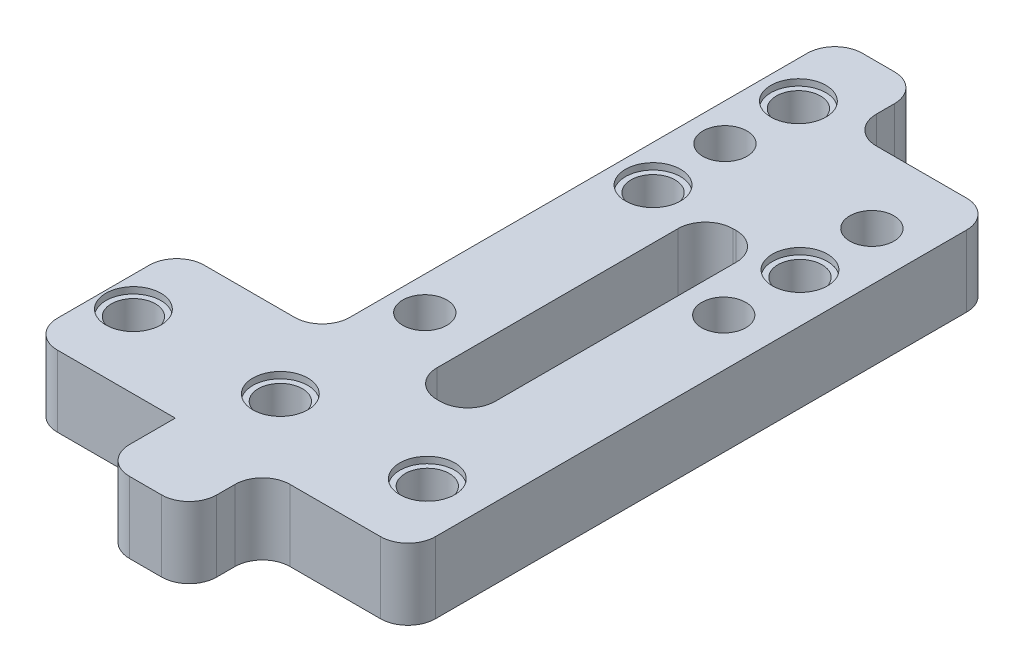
from build123d import *

# Parameters (mm, degrees)
BOSS_EXTRUDE1_DEPTH = 7.75
SKETCH2_W           = 6.34
SKETCH2_H           = 32.23
CUT_EXTRUDE1_DEPTH  = 84.146941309
SKETCH3_R           = 2.4
CUT_EXTRUDE2_DEPTH  = 84.146941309
SKETCH4_R           = 3
CUT_EXTRUDE3_DEPTH  = 0.7
CUT_EXTRUDE4_START  = -0.7
SKETCH5_R           = 3
CUT_EXTRUDE4_DEPTH  = 0.7
FILLET2_R           = 3
SKETCH6_R           = 2.4
CUT_EXTRUDE5_DEPTH  = 84.146941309
SKETCH7_R           = 2.4
CUT_EXTRUDE6_DEPTH  = 84.146941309
SKETCH8_R           = 2.4
CUT_EXTRUDE7_DEPTH  = 84.146941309
SKETCH9_R           = 3
CUT_EXTRUDE8_DEPTH  = 0.7
CUT_EXTRUDE9_START  = -0.7
SKETCH10_R          = 3
CUT_EXTRUDE9_DEPTH  = 0.7


with BuildPart() as part:
    # Sketch1 → Boss-Extrude1 (new body)
    with BuildSketch(Plane(origin=(0, 0, 0), x_dir=(1, 0, 0), z_dir=(0, 1, 0))):
        Polygon((0, 0), (15.841, 0), (15.841, -7.985), (25.341, -7.985), (25.341, 0), (41.182, 0), (41.182, 63.83), (25.341, 63.83), (25.341, 71.815), (15.841, 71.815), (15.841, 16), (0, 16), align=None)
    extrude(amount=BOSS_EXTRUDE1_DEPTH)

    # Sketch2 → Cut-Extrude1 (cut, through all)
    with BuildSketch(Plane(origin=(0, 7.75, 0), x_dir=(1, 0, 0), z_dir=(0, 1, 0))):
        with Locations((28.511, 32.115)):
            Rectangle(SKETCH2_W, SKETCH2_H)
    extrude(amount=-CUT_EXTRUDE1_DEPTH, mode=Mode.SUBTRACT)

    # Sketch3 → Cut-Extrude2 (cut, through all)
    with BuildSketch(Plane(origin=(0, 7.75, 0), x_dir=(-1, 0, 0), z_dir=(0, 1, 0))):
        with Locations(Location((-3.282, -8, 0), (0, 0, 90))):
            Circle(SKETCH3_R)
        with Locations(Location((-35.282, -8, 0), (0, 0, 90))):
            Circle(SKETCH3_R)
        with Locations(Location((-19.282, -8, 0), (0, 0, 90))):
            Circle(SKETCH3_R)
        with Locations(Location((-19.882, -55.81, 0), (0, 0, 90))):
            Circle(SKETCH3_R)
        with Locations(Location((-35.882, -55.81, 0), (0, 0, 90))):
            Circle(SKETCH3_R)
    extrude(amount=-CUT_EXTRUDE2_DEPTH, mode=Mode.SUBTRACT)

    # Sketch4 → Cut-Extrude3 (cut)
    with BuildSketch(Plane(origin=(0, 7.75, 0), x_dir=(-1, 0, 0), z_dir=(0, 1, 0))):
        with Locations(Location((-35.282, -8, 0), (0, 0, 90))):
            Circle(SKETCH4_R)
        with Locations(Location((-19.282, -8, 0), (0, 0, 90))):
            Circle(SKETCH4_R)
        with Locations(Location((-3.282, -8, 0), (0, 0, 90))):
            Circle(SKETCH4_R)
    extrude(amount=-CUT_EXTRUDE3_DEPTH, mode=Mode.SUBTRACT)

    # Sketch5 → Cut-Extrude4 (cut)
    with BuildSketch(Plane.XZ.offset(CUT_EXTRUDE4_START)):
        with Locations(Location((3.282, -8, 0), (0, 0, 90))):
            Circle(SKETCH5_R)
        with Locations(Location((19.282, -8, 0), (0, 0, 90))):
            Circle(SKETCH5_R)
        with Locations(Location((35.282, -8, 0), (0, 0, 90))):
            Circle(SKETCH5_R)
    extrude(amount=CUT_EXTRUDE4_DEPTH, mode=Mode.SUBTRACT)

    # Fillet2
    fillet2_edges = [part.edges().sort_by_distance(p)[0] for p in [
        (0, 3.875, -16),
        (15.841, 3.875, -16),
        (15.841, 3.875, -71.815),
        (25.341, 3.875, -71.815),
        (25.341, 3.875, -63.83),
        (41.182, 3.875, -63.83),
        (41.182, 3.875, 0),
        (25.341, 3.875, 0),
        (25.341, 3.875, 7.985),
        (15.841, 3.875, 7.985),
        (0, 3.875, 0),
        (25.341, 3.875, -16),
        (25.341, 3.875, -48.23),
        (31.681, 3.875, -48.23),
        (31.681, 3.875, -16),
    ]]
    fillet(fillet2_edges, radius=FILLET2_R)

    # Sketch6 → Cut-Extrude5 (cut, through all)
    with BuildSketch(Plane(origin=(0, 7.75, 0), x_dir=(1, 0, 0), z_dir=(0, 1, 0))):
        with Locations(Location((19.482, 23.53, 0), (0, 0, 270))):
            Circle(SKETCH6_R)
    extrude(amount=-CUT_EXTRUDE5_DEPTH, mode=Mode.SUBTRACT)

    # Sketch7 → Cut-Extrude6 (cut, through all)
    with BuildSketch(Plane(origin=(0, 7.75, 0), x_dir=(-1, 0, 0), z_dir=(0, 1, 0))):
        with Locations(Location((-35.982, -39.58, 0), (0, 0, 90))):
            Circle(SKETCH7_R)
    extrude(amount=-CUT_EXTRUDE6_DEPTH, mode=Mode.SUBTRACT)

    # Sketch8 → Cut-Extrude7 (cut, through all)
    with BuildSketch(Plane(origin=(0, 7.75, 0), x_dir=(-1, 0, 0), z_dir=(0, 1, 0))):
        with Locations(Location((-19.882, -47.98, 0), (0, 0, 90))):
            Circle(SKETCH8_R)
        with Locations(Location((-19.882, -63.81, 0), (0, 0, 90))):
            Circle(SKETCH8_R)
        with Locations(Location((-35.882, -47.98, 0), (0, 0, 90))):
            Circle(SKETCH8_R)
    extrude(amount=-CUT_EXTRUDE7_DEPTH, mode=Mode.SUBTRACT)

    # Sketch9 → Cut-Extrude8 (cut)
    with BuildSketch(Plane(origin=(0, 7.75, 0), x_dir=(-1, 0, 0), z_dir=(0, 1, 0))):
        with Locations(Location((-19.882, -63.81, 0), (0, 0, 90))):
            Circle(SKETCH9_R)
        with Locations(Location((-19.882, -47.98, 0), (0, 0, 90))):
            Circle(SKETCH9_R)
        with Locations(Location((-35.882, -47.98, 0), (0, 0, 90))):
            Circle(SKETCH9_R)
    extrude(amount=-CUT_EXTRUDE8_DEPTH, mode=Mode.SUBTRACT)

    # Sketch10 → Cut-Extrude9 (cut)
    with BuildSketch(Plane.XZ.offset(CUT_EXTRUDE9_START)):
        with Locations(Location((19.882, -63.81, 0), (0, 0, 90))):
            Circle(SKETCH10_R)
        with Locations(Location((19.882, -47.98, 0), (0, 0, 90))):
            Circle(SKETCH10_R)
        with Locations(Location((35.882, -47.98, 0), (0, 0, 90))):
            Circle(SKETCH10_R)
    extrude(amount=CUT_EXTRUDE9_DEPTH, mode=Mode.SUBTRACT)


solid = part.part
